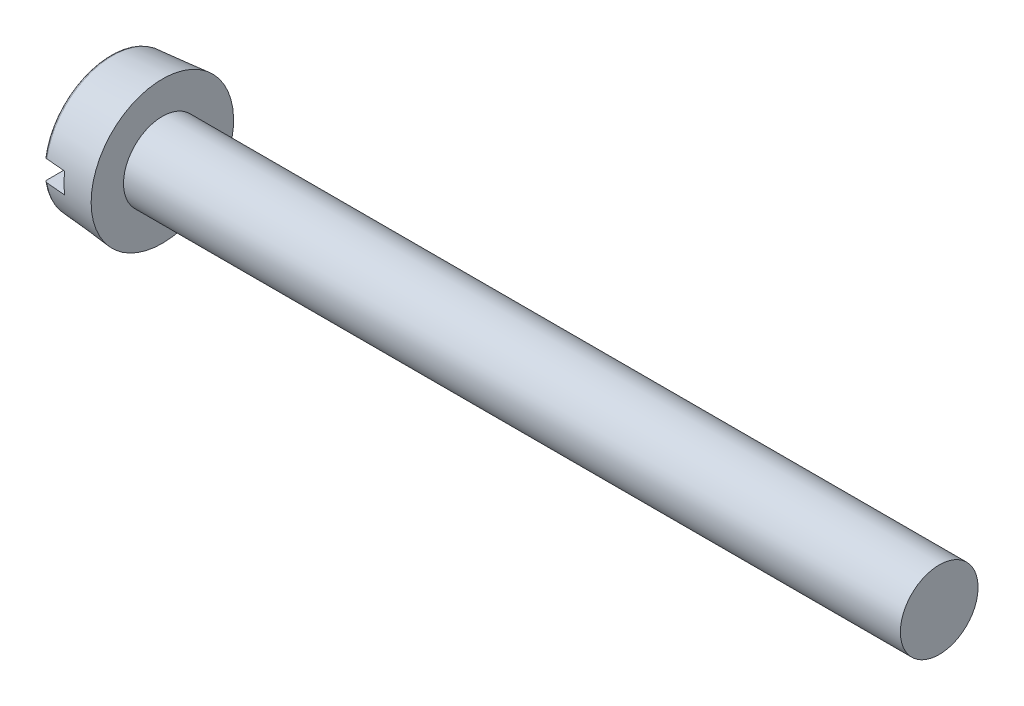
from build123d import *

# Parameters (mm, degrees)
FILLET2_R  = 0.1
SKETCH2_W  = 5.5
SKETCH2_H  = 0.8
SLOT_DEPTH = 0.85


with BuildPart() as part:
    # BodySke → Base-Revolve (revolve)
    with BuildSketch(Plane.XY, mode=Mode.PRIVATE) as base_revolve_sk:
        Polygon((2, 1.5), (2, 2.75), (0, 2.575022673), (0, 0), (32, 0), (32, 1.5), align=None)
    revolve(base_revolve_sk.sketch.rotate(Axis((-25.4, 0, 0), (1, 0, 0)), 90), axis=Axis((-25.4, 0, 0), (1, 0, 0)))

    # Fillet2
    fillet2_edges = [part.edges().sort_by_distance(p)[0] for p in [
        (0, 0, -2.575022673),
    ]]
    fillet(fillet2_edges, radius=FILLET2_R)

    # Sketch2 → Slot (cut)
    with BuildSketch(Plane(origin=(0, 0, 0), x_dir=(0, 0, -1), z_dir=(1, 0, 0))):
        Rectangle(SKETCH2_W, SKETCH2_H)
    extrude(amount=SLOT_DEPTH, mode=Mode.SUBTRACT)


solid = part.part
